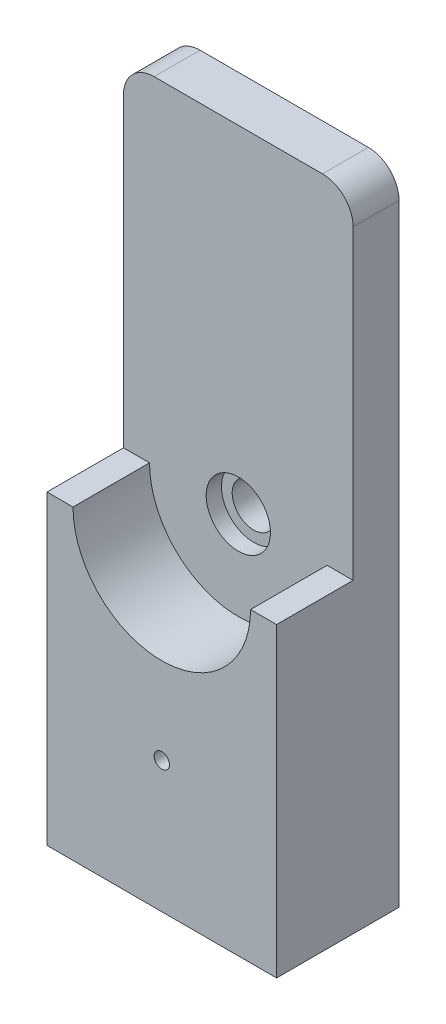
ISO-10303-21;
HEADER;
FILE_DESCRIPTION(('STEP AP214'),'2;1');
FILE_NAME('part.step','',(''),(''),'','','');
FILE_SCHEMA(('AUTOMOTIVE_DESIGN { 1 0 10303 214 1 1 1 1 }'));
ENDSEC;
DATA;
#1=APPLICATION_CONTEXT('core data for automotive mechanical design processes');
#2=APPLICATION_PROTOCOL_DEFINITION('international standard','automotive_design',2000,#1);
#3=PRODUCT_CONTEXT('',#1,'mechanical');
#4=PRODUCT('Part','Part','',(#3));
#5=PRODUCT_RELATED_PRODUCT_CATEGORY('part','',(#4));
#6=PRODUCT_DEFINITION_FORMATION('','',#4);
#7=PRODUCT_DEFINITION_CONTEXT('part definition',#1,'design');
#8=PRODUCT_DEFINITION('design','',#6,#7);
#9=PRODUCT_DEFINITION_SHAPE('','',#8);
#10=(LENGTH_UNIT() NAMED_UNIT(*) SI_UNIT(.MILLI.,.METRE.));
#11=(NAMED_UNIT(*) PLANE_ANGLE_UNIT() SI_UNIT($,.RADIAN.));
#12=(NAMED_UNIT(*) SI_UNIT($,.STERADIAN.) SOLID_ANGLE_UNIT());
#13=UNCERTAINTY_MEASURE_WITH_UNIT(LENGTH_MEASURE(1.E-05),#10,'distance_accuracy_value','');
#14=(GEOMETRIC_REPRESENTATION_CONTEXT(3) GLOBAL_UNCERTAINTY_ASSIGNED_CONTEXT((#13)) GLOBAL_UNIT_ASSIGNED_CONTEXT((#10,
#11,#12)) REPRESENTATION_CONTEXT('',''));
#15=CARTESIAN_POINT('',(0.,0.,0.));
#16=DIRECTION('',(0.,0.,1.));
#17=DIRECTION('',(1.,0.,0.));
#18=AXIS2_PLACEMENT_3D('',#15,#16,#17);
#19=CARTESIAN_POINT('',(0.,0.,15.));
#20=DIRECTION('',(0.,0.,1.));
#21=DIRECTION('',(1.,0.,0.));
#22=AXIS2_PLACEMENT_3D('',#19,#20,#21);
#23=PLANE('',#22);
#24=CARTESIAN_POINT('',(0.,0.,15.));
#25=DIRECTION('',(0.,0.,1.));
#26=DIRECTION('',(1.,0.,0.));
#27=AXIS2_PLACEMENT_3D('',#24,#25,#26);
#28=CIRCLE('',#27,10.5);
#29=CARTESIAN_POINT('',(10.5,0.,15.));
#30=VERTEX_POINT('',#29);
#31=EDGE_CURVE('E178',#30,#30,#28,.T.);
#32=ORIENTED_EDGE('',*,*,#31,.F.);
#33=EDGE_LOOP('',(#32));
#34=FACE_BOUND('',#33,.T.);
#35=CARTESIAN_POINT('',(0.,0.,15.));
#36=DIRECTION('',(0.,0.,1.));
#37=DIRECTION('',(1.,0.,0.));
#38=AXIS2_PLACEMENT_3D('',#35,#36,#37);
#39=CIRCLE('',#38,29.);
#40=CARTESIAN_POINT('',(-29.,0.,15.));
#41=VERTEX_POINT('',#40);
#42=CARTESIAN_POINT('',(29.,0.,15.));
#43=VERTEX_POINT('',#42);
#44=EDGE_CURVE('E59',#41,#43,#39,.T.);
#45=ORIENTED_EDGE('',*,*,#44,.T.);
#46=DIRECTION('',(1.,0.,0.));
#47=VECTOR('',#46,1.);
#48=CARTESIAN_POINT('',(0.,0.,15.));
#49=LINE('',#48,#47);
#50=CARTESIAN_POINT('',(37.5,0.,15.));
#51=VERTEX_POINT('',#50);
#52=EDGE_CURVE('E139',#43,#51,#49,.T.);
#53=ORIENTED_EDGE('',*,*,#52,.T.);
#54=DIRECTION('',(0.,-1.,0.));
#55=VECTOR('',#54,1.);
#56=CARTESIAN_POINT('',(37.5,0.,15.));
#57=LINE('',#56,#55);
#58=CARTESIAN_POINT('',(37.5,100.,15.));
#59=VERTEX_POINT('',#58);
#60=EDGE_CURVE('E175',#59,#51,#57,.T.);
#61=ORIENTED_EDGE('',*,*,#60,.F.);
#62=CARTESIAN_POINT('',(27.5,100.,15.));
#63=DIRECTION('',(0.,0.,1.));
#64=DIRECTION('',(1.,0.,0.));
#65=AXIS2_PLACEMENT_3D('',#62,#63,#64);
#66=CIRCLE('',#65,10.);
#67=CARTESIAN_POINT('',(27.5,110.,15.));
#68=VERTEX_POINT('',#67);
#69=EDGE_CURVE('E129',#68,#59,#66,.F.);
#70=ORIENTED_EDGE('',*,*,#69,.F.);
#71=DIRECTION('',(1.,0.,0.));
#72=VECTOR('',#71,1.);
#73=CARTESIAN_POINT('',(0.,110.,15.));
#74=LINE('',#73,#72);
#75=CARTESIAN_POINT('',(-27.5,110.,15.));
#76=VERTEX_POINT('',#75);
#77=EDGE_CURVE('E166',#76,#68,#74,.T.);
#78=ORIENTED_EDGE('',*,*,#77,.F.);
#79=CARTESIAN_POINT('',(-27.5,100.,15.));
#80=DIRECTION('',(0.,0.,1.));
#81=DIRECTION('',(1.,0.,0.));
#82=AXIS2_PLACEMENT_3D('',#79,#80,#81);
#83=CIRCLE('',#82,10.);
#84=CARTESIAN_POINT('',(-37.5,100.,15.));
#85=VERTEX_POINT('',#84);
#86=EDGE_CURVE('E169',#76,#85,#83,.T.);
#87=ORIENTED_EDGE('',*,*,#86,.T.);
#88=DIRECTION('',(0.,-1.,0.));
#89=VECTOR('',#88,1.);
#90=CARTESIAN_POINT('',(-37.5,0.,15.));
#91=LINE('',#90,#89);
#92=CARTESIAN_POINT('',(-37.5,0.,15.));
#93=VERTEX_POINT('',#92);
#94=EDGE_CURVE('E172',#85,#93,#91,.T.);
#95=ORIENTED_EDGE('',*,*,#94,.T.);
#96=DIRECTION('',(1.,0.,0.));
#97=VECTOR('',#96,1.);
#98=CARTESIAN_POINT('',(0.,0.,15.));
#99=LINE('',#98,#97);
#100=EDGE_CURVE('E156',#93,#41,#99,.T.);
#101=ORIENTED_EDGE('',*,*,#100,.T.);
#102=EDGE_LOOP('',(#45,#53,#61,#70,#78,#87,#95,#101));
#103=FACE_BOUND('',#102,.T.);
#104=ADVANCED_FACE('F43',(#34,#103),#23,.T.);
#105=CARTESIAN_POINT('',(0.,0.,10.));
#106=DIRECTION('',(0.,0.,1.));
#107=DIRECTION('',(1.,0.,0.));
#108=AXIS2_PLACEMENT_3D('',#105,#106,#107);
#109=PLANE('',#108);
#110=CARTESIAN_POINT('',(0.,0.,10.));
#111=DIRECTION('',(0.,0.,1.));
#112=DIRECTION('',(1.,0.,0.));
#113=AXIS2_PLACEMENT_3D('',#110,#111,#112);
#114=CIRCLE('',#113,7.);
#115=CARTESIAN_POINT('',(7.,0.,10.));
#116=VERTEX_POINT('',#115);
#117=EDGE_CURVE('E182',#116,#116,#114,.T.);
#118=ORIENTED_EDGE('',*,*,#117,.F.);
#119=EDGE_LOOP('',(#118));
#120=FACE_BOUND('',#119,.T.);
#121=CARTESIAN_POINT('',(0.,0.,10.));
#122=DIRECTION('',(0.,0.,1.));
#123=DIRECTION('',(1.,0.,0.));
#124=AXIS2_PLACEMENT_3D('',#121,#122,#123);
#125=CIRCLE('',#124,10.5);
#126=CARTESIAN_POINT('',(10.5,0.,10.));
#127=VERTEX_POINT('',#126);
#128=EDGE_CURVE('E11',#127,#127,#125,.F.);
#129=ORIENTED_EDGE('',*,*,#128,.F.);
#130=EDGE_LOOP('',(#129));
#131=FACE_BOUND('',#130,.T.);
#132=ADVANCED_FACE('F249',(#120,#131),#109,.T.);
#133=CARTESIAN_POINT('',(27.5,100.,10.));
#134=DIRECTION('',(0.,0.,-1.));
#135=DIRECTION('',(-1.,0.,0.));
#136=AXIS2_PLACEMENT_3D('',#133,#134,#135);
#137=CYLINDRICAL_SURFACE('',#136,10.);
#138=CARTESIAN_POINT('',(27.5,100.,0.));
#139=DIRECTION('',(0.,0.,1.));
#140=DIRECTION('',(1.,0.,0.));
#141=AXIS2_PLACEMENT_3D('',#138,#139,#140);
#142=CIRCLE('',#141,10.);
#143=CARTESIAN_POINT('',(27.5,110.,0.));
#144=VERTEX_POINT('',#143);
#145=CARTESIAN_POINT('',(37.5,100.,0.));
#146=VERTEX_POINT('',#145);
#147=EDGE_CURVE('E180',#144,#146,#142,.F.);
#148=ORIENTED_EDGE('',*,*,#147,.F.);
#149=DIRECTION('',(0.,0.,-1.));
#150=VECTOR('',#149,1.);
#151=CARTESIAN_POINT('',(27.5,110.,10.));
#152=LINE('',#151,#150);
#153=EDGE_CURVE('E47',#68,#144,#152,.T.);
#154=ORIENTED_EDGE('',*,*,#153,.F.);
#155=ORIENTED_EDGE('',*,*,#69,.T.);
#156=DIRECTION('',(0.,0.,-1.));
#157=VECTOR('',#156,1.);
#158=CARTESIAN_POINT('',(37.5,100.,10.));
#159=LINE('',#158,#157);
#160=EDGE_CURVE('E67',#59,#146,#159,.T.);
#161=ORIENTED_EDGE('',*,*,#160,.T.);
#162=EDGE_LOOP('',(#148,#154,#155,#161));
#163=FACE_BOUND('',#162,.T.);
#164=ADVANCED_FACE('F45',(#163),#137,.T.);
#165=CARTESIAN_POINT('',(0.,110.,10.));
#166=DIRECTION('',(0.,1.,0.));
#167=DIRECTION('',(0.,0.,1.));
#168=AXIS2_PLACEMENT_3D('',#165,#166,#167);
#169=PLANE('',#168);
#170=DIRECTION('',(1.,0.,0.));
#171=VECTOR('',#170,1.);
#172=CARTESIAN_POINT('',(0.,110.,0.));
#173=LINE('',#172,#171);
#174=CARTESIAN_POINT('',(-27.5,110.,0.));
#175=VERTEX_POINT('',#174);
#176=EDGE_CURVE('E187',#175,#144,#173,.T.);
#177=ORIENTED_EDGE('',*,*,#176,.F.);
#178=DIRECTION('',(0.,0.,-1.));
#179=VECTOR('',#178,1.);
#180=CARTESIAN_POINT('',(-27.5,110.,10.));
#181=LINE('',#180,#179);
#182=EDGE_CURVE('E210',#76,#175,#181,.T.);
#183=ORIENTED_EDGE('',*,*,#182,.F.);
#184=ORIENTED_EDGE('',*,*,#77,.T.);
#185=ORIENTED_EDGE('',*,*,#153,.T.);
#186=EDGE_LOOP('',(#177,#183,#184,#185));
#187=FACE_BOUND('',#186,.T.);
#188=ADVANCED_FACE('F216',(#187),#169,.T.);
#189=CARTESIAN_POINT('',(-27.5,100.,10.));
#190=DIRECTION('',(0.,0.,-1.));
#191=DIRECTION('',(-1.,0.,0.));
#192=AXIS2_PLACEMENT_3D('',#189,#190,#191);
#193=CYLINDRICAL_SURFACE('',#192,10.);
#194=CARTESIAN_POINT('',(-27.5,100.,0.));
#195=DIRECTION('',(0.,0.,1.));
#196=DIRECTION('',(1.,0.,0.));
#197=AXIS2_PLACEMENT_3D('',#194,#195,#196);
#198=CIRCLE('',#197,10.);
#199=CARTESIAN_POINT('',(-37.5,100.,0.));
#200=VERTEX_POINT('',#199);
#201=EDGE_CURVE('E190',#175,#200,#198,.T.);
#202=ORIENTED_EDGE('',*,*,#201,.T.);
#203=DIRECTION('',(0.,0.,-1.));
#204=VECTOR('',#203,1.);
#205=CARTESIAN_POINT('',(-37.5,100.,10.));
#206=LINE('',#205,#204);
#207=EDGE_CURVE('E208',#85,#200,#206,.T.);
#208=ORIENTED_EDGE('',*,*,#207,.F.);
#209=ORIENTED_EDGE('',*,*,#86,.F.);
#210=ORIENTED_EDGE('',*,*,#182,.T.);
#211=EDGE_LOOP('',(#202,#208,#209,#210));
#212=FACE_BOUND('',#211,.T.);
#213=ADVANCED_FACE('F225',(#212),#193,.T.);
#214=CARTESIAN_POINT('',(-37.5,0.,10.));
#215=DIRECTION('',(1.,0.,0.));
#216=DIRECTION('',(0.,0.,-1.));
#217=AXIS2_PLACEMENT_3D('',#214,#215,#216);
#218=PLANE('',#217);
#219=DIRECTION('',(0.,-1.,0.));
#220=VECTOR('',#219,1.);
#221=CARTESIAN_POINT('',(-37.5,0.,0.));
#222=LINE('',#221,#220);
#223=CARTESIAN_POINT('',(-37.5,-100.,0.));
#224=VERTEX_POINT('',#223);
#225=EDGE_CURVE('E192',#200,#224,#222,.T.);
#226=ORIENTED_EDGE('',*,*,#225,.T.);
#227=DIRECTION('',(0.,0.,-1.));
#228=VECTOR('',#227,1.);
#229=CARTESIAN_POINT('',(-37.5,-100.,10.));
#230=LINE('',#229,#228);
#231=CARTESIAN_POINT('',(-37.5,-100.,40.));
#232=VERTEX_POINT('',#231);
#233=EDGE_CURVE('E205',#232,#224,#230,.T.);
#234=ORIENTED_EDGE('',*,*,#233,.F.);
#235=DIRECTION('',(0.,-1.,0.));
#236=VECTOR('',#235,1.);
#237=CARTESIAN_POINT('',(-37.5,0.,40.));
#238=LINE('',#237,#236);
#239=CARTESIAN_POINT('',(-37.5,0.,40.));
#240=VERTEX_POINT('',#239);
#241=EDGE_CURVE('E143',#240,#232,#238,.T.);
#242=ORIENTED_EDGE('',*,*,#241,.F.);
#243=DIRECTION('',(0.,0.,-1.));
#244=VECTOR('',#243,1.);
#245=CARTESIAN_POINT('',(-37.5,0.,40.));
#246=LINE('',#245,#244);
#247=EDGE_CURVE('E130',#240,#93,#246,.T.);
#248=ORIENTED_EDGE('',*,*,#247,.T.);
#249=ORIENTED_EDGE('',*,*,#94,.F.);
#250=ORIENTED_EDGE('',*,*,#207,.T.);
#251=EDGE_LOOP('',(#226,#234,#242,#248,#249,#250));
#252=FACE_BOUND('',#251,.T.);
#253=ADVANCED_FACE('F228',(#252),#218,.F.);
#254=CARTESIAN_POINT('',(0.,-100.,10.));
#255=DIRECTION('',(0.,1.,0.));
#256=DIRECTION('',(0.,0.,1.));
#257=AXIS2_PLACEMENT_3D('',#254,#255,#256);
#258=PLANE('',#257);
#259=DIRECTION('',(1.,0.,0.));
#260=VECTOR('',#259,1.);
#261=CARTESIAN_POINT('',(0.,-100.,0.));
#262=LINE('',#261,#260);
#263=CARTESIAN_POINT('',(37.5,-100.,0.));
#264=VERTEX_POINT('',#263);
#265=EDGE_CURVE('E194',#224,#264,#262,.T.);
#266=ORIENTED_EDGE('',*,*,#265,.T.);
#267=DIRECTION('',(0.,0.,-1.));
#268=VECTOR('',#267,1.);
#269=CARTESIAN_POINT('',(37.5,-100.,10.));
#270=LINE('',#269,#268);
#271=CARTESIAN_POINT('',(37.5,-100.,40.));
#272=VERTEX_POINT('',#271);
#273=EDGE_CURVE('E203',#272,#264,#270,.T.);
#274=ORIENTED_EDGE('',*,*,#273,.F.);
#275=DIRECTION('',(1.,0.,0.));
#276=VECTOR('',#275,1.);
#277=CARTESIAN_POINT('',(0.,-100.,40.));
#278=LINE('',#277,#276);
#279=EDGE_CURVE('E145',#232,#272,#278,.T.);
#280=ORIENTED_EDGE('',*,*,#279,.F.);
#281=ORIENTED_EDGE('',*,*,#233,.T.);
#282=EDGE_LOOP('',(#266,#274,#280,#281));
#283=FACE_BOUND('',#282,.T.);
#284=ADVANCED_FACE('F237',(#283),#258,.F.);
#285=CARTESIAN_POINT('',(37.5,0.,10.));
#286=DIRECTION('',(1.,0.,0.));
#287=DIRECTION('',(0.,0.,-1.));
#288=AXIS2_PLACEMENT_3D('',#285,#286,#287);
#289=PLANE('',#288);
#290=DIRECTION('',(0.,-1.,0.));
#291=VECTOR('',#290,1.);
#292=CARTESIAN_POINT('',(37.5,0.,0.));
#293=LINE('',#292,#291);
#294=EDGE_CURVE('E197',#146,#264,#293,.T.);
#295=ORIENTED_EDGE('',*,*,#294,.F.);
#296=ORIENTED_EDGE('',*,*,#160,.F.);
#297=ORIENTED_EDGE('',*,*,#60,.T.);
#298=DIRECTION('',(0.,0.,-1.));
#299=VECTOR('',#298,1.);
#300=CARTESIAN_POINT('',(37.5,0.,40.));
#301=LINE('',#300,#299);
#302=CARTESIAN_POINT('',(37.5,0.,40.));
#303=VERTEX_POINT('',#302);
#304=EDGE_CURVE('E162',#303,#51,#301,.T.);
#305=ORIENTED_EDGE('',*,*,#304,.F.);
#306=DIRECTION('',(0.,1.,0.));
#307=VECTOR('',#306,1.);
#308=CARTESIAN_POINT('',(37.5,0.,40.));
#309=LINE('',#308,#307);
#310=EDGE_CURVE('E151',#272,#303,#309,.T.);
#311=ORIENTED_EDGE('',*,*,#310,.F.);
#312=ORIENTED_EDGE('',*,*,#273,.T.);
#313=EDGE_LOOP('',(#295,#296,#297,#305,#311,#312));
#314=FACE_BOUND('',#313,.T.);
#315=ADVANCED_FACE('F234',(#314),#289,.T.);
#316=CARTESIAN_POINT('',(0.,0.,10.));
#317=DIRECTION('',(0.,0.,-1.));
#318=DIRECTION('',(-1.,0.,0.));
#319=AXIS2_PLACEMENT_3D('',#316,#317,#318);
#320=CYLINDRICAL_SURFACE('',#319,7.);
#321=ORIENTED_EDGE('',*,*,#117,.T.);
#322=EDGE_LOOP('',(#321));
#323=FACE_BOUND('',#322,.T.);
#324=CARTESIAN_POINT('',(0.,0.,0.));
#325=DIRECTION('',(0.,0.,1.));
#326=DIRECTION('',(1.,0.,0.));
#327=AXIS2_PLACEMENT_3D('',#324,#325,#326);
#328=CIRCLE('',#327,7.);
#329=CARTESIAN_POINT('',(7.,0.,0.));
#330=VERTEX_POINT('',#329);
#331=EDGE_CURVE('E185',#330,#330,#328,.T.);
#332=ORIENTED_EDGE('',*,*,#331,.F.);
#333=EDGE_LOOP('',(#332));
#334=FACE_BOUND('',#333,.T.);
#335=ADVANCED_FACE('F245',(#323,#334),#320,.F.);
#336=CARTESIAN_POINT('',(0.,0.,0.));
#337=DIRECTION('',(0.,0.,1.));
#338=DIRECTION('',(1.,0.,0.));
#339=AXIS2_PLACEMENT_3D('',#336,#337,#338);
#340=PLANE('',#339);
#341=CARTESIAN_POINT('',(0.,-57.1823401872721,0.));
#342=DIRECTION('',(0.,0.,1.));
#343=DIRECTION('',(1.,0.,0.));
#344=AXIS2_PLACEMENT_3D('',#341,#342,#343);
#345=CIRCLE('',#344,2.5);
#346=CARTESIAN_POINT('',(2.5,-57.1823401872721,0.));
#347=VERTEX_POINT('',#346);
#348=EDGE_CURVE('E157',#347,#347,#345,.F.);
#349=ORIENTED_EDGE('',*,*,#348,.F.);
#350=EDGE_LOOP('',(#349));
#351=FACE_BOUND('',#350,.T.);
#352=ORIENTED_EDGE('',*,*,#147,.T.);
#353=ORIENTED_EDGE('',*,*,#294,.T.);
#354=ORIENTED_EDGE('',*,*,#265,.F.);
#355=ORIENTED_EDGE('',*,*,#225,.F.);
#356=ORIENTED_EDGE('',*,*,#201,.F.);
#357=ORIENTED_EDGE('',*,*,#176,.T.);
#358=EDGE_LOOP('',(#352,#353,#354,#355,#356,#357));
#359=FACE_BOUND('',#358,.T.);
#360=ORIENTED_EDGE('',*,*,#331,.T.);
#361=EDGE_LOOP('',(#360));
#362=FACE_BOUND('',#361,.T.);
#363=ADVANCED_FACE('F221',(#351,#359,#362),#340,.F.);
#364=CARTESIAN_POINT('',(0.,0.,15.));
#365=DIRECTION('',(0.,0.,-1.));
#366=DIRECTION('',(-1.,0.,0.));
#367=AXIS2_PLACEMENT_3D('',#364,#365,#366);
#368=CYLINDRICAL_SURFACE('',#367,10.5);
#369=ORIENTED_EDGE('',*,*,#128,.T.);
#370=EDGE_LOOP('',(#369));
#371=FACE_BOUND('',#370,.T.);
#372=ORIENTED_EDGE('',*,*,#31,.T.);
#373=EDGE_LOOP('',(#372));
#374=FACE_BOUND('',#373,.T.);
#375=ADVANCED_FACE('F262',(#371,#374),#368,.F.);
#376=CARTESIAN_POINT('',(0.,0.,40.));
#377=DIRECTION('',(0.,0.,-1.));
#378=DIRECTION('',(-1.,0.,0.));
#379=AXIS2_PLACEMENT_3D('',#376,#377,#378);
#380=CYLINDRICAL_SURFACE('',#379,29.);
#381=ORIENTED_EDGE('',*,*,#44,.F.);
#382=DIRECTION('',(0.,0.,-1.));
#383=VECTOR('',#382,1.);
#384=CARTESIAN_POINT('',(-29.,0.,40.));
#385=LINE('',#384,#383);
#386=CARTESIAN_POINT('',(-29.,0.,40.));
#387=VERTEX_POINT('',#386);
#388=EDGE_CURVE('E120',#387,#41,#385,.T.);
#389=ORIENTED_EDGE('',*,*,#388,.F.);
#390=CARTESIAN_POINT('',(0.,0.,40.));
#391=DIRECTION('',(0.,0.,1.));
#392=DIRECTION('',(1.,0.,0.));
#393=AXIS2_PLACEMENT_3D('',#390,#391,#392);
#394=CIRCLE('',#393,29.);
#395=CARTESIAN_POINT('',(29.,0.,40.));
#396=VERTEX_POINT('',#395);
#397=EDGE_CURVE('E123',#387,#396,#394,.T.);
#398=ORIENTED_EDGE('',*,*,#397,.T.);
#399=DIRECTION('',(0.,0.,-1.));
#400=VECTOR('',#399,1.);
#401=CARTESIAN_POINT('',(29.,0.,40.));
#402=LINE('',#401,#400);
#403=EDGE_CURVE('E154',#396,#43,#402,.T.);
#404=ORIENTED_EDGE('',*,*,#403,.T.);
#405=EDGE_LOOP('',(#381,#389,#398,#404));
#406=FACE_BOUND('',#405,.T.);
#407=ADVANCED_FACE('F122',(#406),#380,.F.);
#408=CARTESIAN_POINT('',(0.,0.,40.));
#409=DIRECTION('',(0.,1.,0.));
#410=DIRECTION('',(0.,0.,1.));
#411=AXIS2_PLACEMENT_3D('',#408,#409,#410);
#412=PLANE('',#411);
#413=ORIENTED_EDGE('',*,*,#100,.F.);
#414=ORIENTED_EDGE('',*,*,#247,.F.);
#415=DIRECTION('',(1.,0.,0.));
#416=VECTOR('',#415,1.);
#417=CARTESIAN_POINT('',(0.,0.,40.));
#418=LINE('',#417,#416);
#419=EDGE_CURVE('E136',#240,#387,#418,.T.);
#420=ORIENTED_EDGE('',*,*,#419,.T.);
#421=ORIENTED_EDGE('',*,*,#388,.T.);
#422=EDGE_LOOP('',(#413,#414,#420,#421));
#423=FACE_BOUND('',#422,.T.);
#424=ADVANCED_FACE('F141',(#423),#412,.T.);
#425=CARTESIAN_POINT('',(0.,0.,40.));
#426=DIRECTION('',(0.,1.,0.));
#427=DIRECTION('',(0.,0.,1.));
#428=AXIS2_PLACEMENT_3D('',#425,#426,#427);
#429=PLANE('',#428);
#430=ORIENTED_EDGE('',*,*,#52,.F.);
#431=ORIENTED_EDGE('',*,*,#403,.F.);
#432=DIRECTION('',(1.,0.,0.));
#433=VECTOR('',#432,1.);
#434=CARTESIAN_POINT('',(0.,0.,40.));
#435=LINE('',#434,#433);
#436=EDGE_CURVE('E138',#396,#303,#435,.T.);
#437=ORIENTED_EDGE('',*,*,#436,.T.);
#438=ORIENTED_EDGE('',*,*,#304,.T.);
#439=EDGE_LOOP('',(#430,#431,#437,#438));
#440=FACE_BOUND('',#439,.T.);
#441=ADVANCED_FACE('F363',(#440),#429,.T.);
#442=CARTESIAN_POINT('',(0.,0.,40.));
#443=DIRECTION('',(0.,0.,1.));
#444=DIRECTION('',(1.,0.,0.));
#445=AXIS2_PLACEMENT_3D('',#442,#443,#444);
#446=PLANE('',#445);
#447=CARTESIAN_POINT('',(0.,-57.1823401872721,40.));
#448=DIRECTION('',(0.,0.,1.));
#449=DIRECTION('',(1.,0.,0.));
#450=AXIS2_PLACEMENT_3D('',#447,#448,#449);
#451=CIRCLE('',#450,2.5);
#452=CARTESIAN_POINT('',(2.5,-57.1823401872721,40.));
#453=VERTEX_POINT('',#452);
#454=EDGE_CURVE('E398',#453,#453,#451,.T.);
#455=ORIENTED_EDGE('',*,*,#454,.F.);
#456=EDGE_LOOP('',(#455));
#457=FACE_BOUND('',#456,.T.);
#458=ORIENTED_EDGE('',*,*,#397,.F.);
#459=ORIENTED_EDGE('',*,*,#419,.F.);
#460=ORIENTED_EDGE('',*,*,#241,.T.);
#461=ORIENTED_EDGE('',*,*,#279,.T.);
#462=ORIENTED_EDGE('',*,*,#310,.T.);
#463=ORIENTED_EDGE('',*,*,#436,.F.);
#464=EDGE_LOOP('',(#458,#459,#460,#461,#462,#463));
#465=FACE_BOUND('',#464,.T.);
#466=ADVANCED_FACE('F134',(#457,#465),#446,.T.);
#467=CARTESIAN_POINT('',(0.,-57.1823401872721,-7.07106781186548));
#468=DIRECTION('',(0.,0.,1.));
#469=DIRECTION('',(1.,0.,0.));
#470=AXIS2_PLACEMENT_3D('',#467,#468,#469);
#471=CYLINDRICAL_SURFACE('',#470,2.5);
#472=ORIENTED_EDGE('',*,*,#348,.T.);
#473=EDGE_LOOP('',(#472));
#474=FACE_BOUND('',#473,.T.);
#475=ORIENTED_EDGE('',*,*,#454,.T.);
#476=EDGE_LOOP('',(#475));
#477=FACE_BOUND('',#476,.T.);
#478=ADVANCED_FACE('F380',(#474,#477),#471,.F.);
#479=CLOSED_SHELL('',(#104,#132,#164,#188,#213,#253,#284,#315,#335,#363,#375,#407,#424,#441,
#466,#478));
#480=MANIFOLD_SOLID_BREP('B2',#479);
#481=ADVANCED_BREP_SHAPE_REPRESENTATION('',(#18,#480),#14);
#482=SHAPE_DEFINITION_REPRESENTATION(#9,#481);
ENDSEC;
END-ISO-10303-21;
